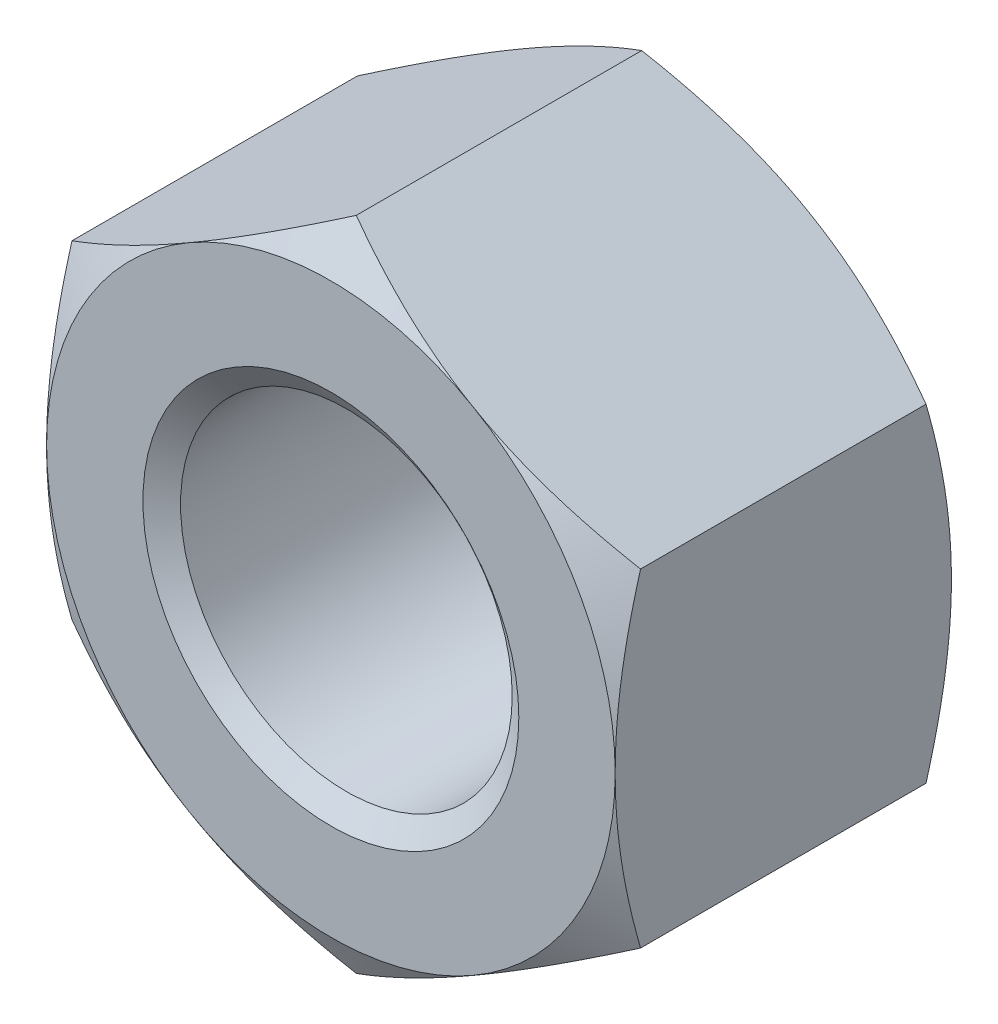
ISO-10303-21;
HEADER;
FILE_DESCRIPTION(('STEP AP214'),'2;1');
FILE_NAME('part.step','',(''),(''),'','','');
FILE_SCHEMA(('AUTOMOTIVE_DESIGN { 1 0 10303 214 1 1 1 1 }'));
ENDSEC;
DATA;
#1=APPLICATION_CONTEXT('core data for automotive mechanical design processes');
#2=APPLICATION_PROTOCOL_DEFINITION('international standard','automotive_design',2000,#1);
#3=PRODUCT_CONTEXT('',#1,'mechanical');
#4=PRODUCT('Part','Part','',(#3));
#5=PRODUCT_RELATED_PRODUCT_CATEGORY('part','',(#4));
#6=PRODUCT_DEFINITION_FORMATION('','',#4);
#7=PRODUCT_DEFINITION_CONTEXT('part definition',#1,'design');
#8=PRODUCT_DEFINITION('design','',#6,#7);
#9=PRODUCT_DEFINITION_SHAPE('','',#8);
#10=(LENGTH_UNIT() NAMED_UNIT(*) SI_UNIT(.MILLI.,.METRE.));
#11=(NAMED_UNIT(*) PLANE_ANGLE_UNIT() SI_UNIT($,.RADIAN.));
#12=(NAMED_UNIT(*) SI_UNIT($,.STERADIAN.) SOLID_ANGLE_UNIT());
#13=UNCERTAINTY_MEASURE_WITH_UNIT(LENGTH_MEASURE(1.E-05),#10,'distance_accuracy_value','');
#14=(GEOMETRIC_REPRESENTATION_CONTEXT(3) GLOBAL_UNCERTAINTY_ASSIGNED_CONTEXT((#13)) GLOBAL_UNIT_ASSIGNED_CONTEXT((#10,
#11,#12)) REPRESENTATION_CONTEXT('',''));
#15=CARTESIAN_POINT('',(0.,0.,0.));
#16=DIRECTION('',(0.,0.,1.));
#17=DIRECTION('',(1.,0.,0.));
#18=AXIS2_PLACEMENT_3D('',#15,#16,#17);
#19=CARTESIAN_POINT('',(0.,21.9970452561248,-22.5298));
#20=DIRECTION('',(-0.500000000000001,0.866025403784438,0.));
#21=DIRECTION('',(-0.866025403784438,-0.500000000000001,0.));
#22=AXIS2_PLACEMENT_3D('',#19,#20,#21);
#23=PLANE('',#22);
#24=DIRECTION('',(0.,0.,1.));
#25=VECTOR('',#24,1.);
#26=CARTESIAN_POINT('',(-19.05,10.9985226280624,-22.5298));
#27=LINE('',#26,#25);
#28=CARTESIAN_POINT('',(-19.05,10.9985226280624,-20.8283226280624));
#29=VERTEX_POINT('',#28);
#30=CARTESIAN_POINT('',(-19.05,10.9985226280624,-1.70147737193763));
#31=VERTEX_POINT('',#30);
#32=EDGE_CURVE('E162',#29,#31,#27,.T.);
#33=ORIENTED_EDGE('',*,*,#32,.T.);
#34=CARTESIAN_POINT('',(-19.0502,10.9984071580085,-1.70154403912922));
#35=CARTESIAN_POINT('',(-18.6314889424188,11.2401500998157,-1.56198341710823));
#36=CARTESIAN_POINT('',(-18.2111446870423,11.4828359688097,-1.42875584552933));
#37=CARTESIAN_POINT('',(-17.3670855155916,11.9701537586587,-1.17672716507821));
#38=CARTESIAN_POINT('',(-16.9433695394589,12.2147862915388,-1.05793080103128));
#39=CARTESIAN_POINT('',(-16.0917480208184,12.7064702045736,-0.836361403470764));
#40=CARTESIAN_POINT('',(-15.6638350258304,12.9535258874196,-0.733626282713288));
#41=CARTESIAN_POINT('',(-14.8050356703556,13.4493539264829,-0.546385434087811));
#42=CARTESIAN_POINT('',(-14.374149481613,13.6981261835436,-0.461878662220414));
#43=CARTESIAN_POINT('',(-13.5204444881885,14.1910129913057,-0.314688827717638));
#44=CARTESIAN_POINT('',(-13.0976890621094,14.4350909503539,-0.251518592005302));
#45=CARTESIAN_POINT('',(-12.250241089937,14.9243652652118,-0.145596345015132));
#46=CARTESIAN_POINT('',(-11.8255485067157,15.1695616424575,-0.10284472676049));
#47=CARTESIAN_POINT('',(-10.9754499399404,15.6603662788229,-0.0388391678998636));
#48=CARTESIAN_POINT('',(-10.5500454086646,15.9059736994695,-0.0175596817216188));
#49=CARTESIAN_POINT('',(-9.69884369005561,16.397415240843,0.00304398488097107));
#50=CARTESIAN_POINT('',(-9.27304651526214,16.6432493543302,0.0023688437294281));
#51=CARTESIAN_POINT('',(-8.47700964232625,17.1028414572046,-0.0194033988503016));
#52=CARTESIAN_POINT('',(-8.10671322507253,17.316632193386,-0.0378455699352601));
#53=CARTESIAN_POINT('',(-7.36700369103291,17.7437036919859,-0.0909844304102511));
#54=CARTESIAN_POINT('',(-6.99759056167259,17.9569844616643,-0.125680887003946));
#55=CARTESIAN_POINT('',(-6.25978756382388,18.3829552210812,-0.210726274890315));
#56=CARTESIAN_POINT('',(-5.89139892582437,18.5956445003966,-0.261089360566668));
#57=CARTESIAN_POINT('',(-5.15637533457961,19.0200105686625,-0.376579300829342));
#58=CARTESIAN_POINT('',(-4.78974037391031,19.2316873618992,-0.441706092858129));
#59=CARTESIAN_POINT('',(-3.67677271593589,19.8742595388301,-0.660888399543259));
#60=CARTESIAN_POINT('',(-2.93366305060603,20.3032941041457,-0.836799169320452));
#61=CARTESIAN_POINT('',(-1.45852420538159,21.1549659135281,-1.23604434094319));
#62=CARTESIAN_POINT('',(-0.726476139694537,21.5776140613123,-1.45928498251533));
#63=CARTESIAN_POINT('',(0.000200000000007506,21.9971607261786,-1.70154403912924));
#64=B_SPLINE_CURVE_WITH_KNOTS('',3,(#34,#35,#36,#37,#38,#39,#40,#41,#42,#43,#44,#45,#46,#47,#48,
#49,#50,#51,#52,#53,#54,#55,#56,#57,#58,#59,#60,#61,#62,#63),.UNSPECIFIED.,.F.,.F.,(4,2,2,2,2,2,
2,2,2,2,2,2,2,2,4),(0.,1.50971559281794,3.01992622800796,4.53364959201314,6.04728623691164,
7.52356313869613,8.99986845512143,10.4744153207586,11.9489166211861,13.2325441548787,
14.5161533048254,15.8009255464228,17.085692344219,19.7118183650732,22.3327898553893),.UNSPECIFIED.);
#65=CARTESIAN_POINT('',(-9.52500000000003,16.4977839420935,0.));
#66=VERTEX_POINT('',#65);
#67=EDGE_CURVE('E58',#31,#66,#64,.T.);
#68=ORIENTED_EDGE('',*,*,#67,.T.);
#69=CARTESIAN_POINT('',(0.,21.9970452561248,-1.70147737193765));
#70=VERTEX_POINT('',#69);
#71=EDGE_CURVE('E206',#66,#70,#64,.T.);
#72=ORIENTED_EDGE('',*,*,#71,.T.);
#73=DIRECTION('',(0.,0.,1.));
#74=VECTOR('',#73,1.);
#75=CARTESIAN_POINT('',(0.,21.9970452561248,-22.5298));
#76=LINE('',#75,#74);
#77=CARTESIAN_POINT('',(0.,21.9970452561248,-20.8283226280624));
#78=VERTEX_POINT('',#77);
#79=EDGE_CURVE('E147',#78,#70,#76,.T.);
#80=ORIENTED_EDGE('',*,*,#79,.F.);
#81=CARTESIAN_POINT('',(-19.0502,10.9984071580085,-20.8282559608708));
#82=CARTESIAN_POINT('',(-18.6314889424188,11.2401500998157,-20.9678165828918));
#83=CARTESIAN_POINT('',(-18.2111446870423,11.4828359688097,-21.1010441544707));
#84=CARTESIAN_POINT('',(-17.3670855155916,11.9701537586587,-21.3530728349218));
#85=CARTESIAN_POINT('',(-16.9433695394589,12.2147862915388,-21.4718691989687));
#86=CARTESIAN_POINT('',(-16.0917480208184,12.7064702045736,-21.6934385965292));
#87=CARTESIAN_POINT('',(-15.6638350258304,12.9535258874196,-21.7961737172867));
#88=CARTESIAN_POINT('',(-14.8050356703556,13.4493539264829,-21.9834145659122));
#89=CARTESIAN_POINT('',(-14.374149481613,13.6981261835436,-22.0679213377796));
#90=CARTESIAN_POINT('',(-13.5204444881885,14.1910129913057,-22.2151111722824));
#91=CARTESIAN_POINT('',(-13.0976890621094,14.4350909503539,-22.2782814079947));
#92=CARTESIAN_POINT('',(-12.250241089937,14.9243652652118,-22.3842036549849));
#93=CARTESIAN_POINT('',(-11.8255485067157,15.1695616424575,-22.4269552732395));
#94=CARTESIAN_POINT('',(-10.9754499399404,15.6603662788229,-22.4909608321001));
#95=CARTESIAN_POINT('',(-10.5500454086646,15.9059736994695,-22.5122403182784));
#96=CARTESIAN_POINT('',(-9.69884369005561,16.397415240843,-22.532843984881));
#97=CARTESIAN_POINT('',(-9.27304651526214,16.6432493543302,-22.5321688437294));
#98=CARTESIAN_POINT('',(-8.47700964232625,17.1028414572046,-22.5103966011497));
#99=CARTESIAN_POINT('',(-8.10671322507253,17.316632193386,-22.4919544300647));
#100=CARTESIAN_POINT('',(-7.36700369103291,17.7437036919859,-22.4388155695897));
#101=CARTESIAN_POINT('',(-6.99759056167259,17.9569844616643,-22.4041191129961));
#102=CARTESIAN_POINT('',(-6.25978756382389,18.3829552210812,-22.3190737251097));
#103=CARTESIAN_POINT('',(-5.89139892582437,18.5956445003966,-22.2687106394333));
#104=CARTESIAN_POINT('',(-5.15637533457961,19.0200105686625,-22.1532206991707));
#105=CARTESIAN_POINT('',(-4.78974037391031,19.2316873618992,-22.0880939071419));
#106=CARTESIAN_POINT('',(-3.67677271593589,19.8742595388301,-21.8689116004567));
#107=CARTESIAN_POINT('',(-2.93366305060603,20.3032941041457,-21.6930008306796));
#108=CARTESIAN_POINT('',(-1.45852420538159,21.1549659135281,-21.2937556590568));
#109=CARTESIAN_POINT('',(-0.726476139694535,21.5776140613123,-21.0705150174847));
#110=CARTESIAN_POINT('',(0.00020000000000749,21.9971607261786,-20.8282559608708));
#111=B_SPLINE_CURVE_WITH_KNOTS('',3,(#81,#82,#83,#84,#85,#86,#87,#88,#89,#90,#91,#92,#93,#94,
#95,#96,#97,#98,#99,#100,#101,#102,#103,#104,#105,#106,#107,#108,#109,#110),.UNSPECIFIED.,.F.,
.F.,(4,2,2,2,2,2,2,2,2,2,2,2,2,2,4),(0.,1.50971559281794,3.01992622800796,4.53364959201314,
6.04728623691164,7.52356313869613,8.99986845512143,10.4744153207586,11.9489166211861,
13.2325441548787,14.5161533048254,15.8009255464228,17.085692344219,19.7118183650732,
22.3327898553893),.UNSPECIFIED.);
#112=CARTESIAN_POINT('',(-9.52500000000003,16.4977839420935,-22.5298));
#113=VERTEX_POINT('',#112);
#114=EDGE_CURVE('E165',#113,#78,#111,.T.);
#115=ORIENTED_EDGE('',*,*,#114,.F.);
#116=EDGE_CURVE('E212',#29,#113,#111,.T.);
#117=ORIENTED_EDGE('',*,*,#116,.F.);
#118=EDGE_LOOP('',(#33,#68,#72,#80,#115,#117));
#119=FACE_BOUND('',#118,.T.);
#120=ADVANCED_FACE('F35',(#119),#23,.T.);
#121=CARTESIAN_POINT('',(19.05,10.9985226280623,-22.5298));
#122=DIRECTION('',(0.500000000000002,0.866025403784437,0.));
#123=DIRECTION('',(-0.866025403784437,0.500000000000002,0.));
#124=AXIS2_PLACEMENT_3D('',#121,#122,#123);
#125=PLANE('',#124);
#126=ORIENTED_EDGE('',*,*,#79,.T.);
#127=CARTESIAN_POINT('',(-0.000199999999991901,21.9971607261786,-1.70154403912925));
#128=CARTESIAN_POINT('',(0.418511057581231,21.7554177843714,-1.56198341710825));
#129=CARTESIAN_POINT('',(0.838855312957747,21.5127319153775,-1.42875584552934));
#130=CARTESIAN_POINT('',(1.68291448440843,21.0254141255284,-1.17672716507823));
#131=CARTESIAN_POINT('',(2.10663046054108,20.7807815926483,-1.05793080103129));
#132=CARTESIAN_POINT('',(2.95825197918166,20.2890976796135,-0.836361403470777));
#133=CARTESIAN_POINT('',(3.38616497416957,20.0420419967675,-0.733626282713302));
#134=CARTESIAN_POINT('',(4.24496432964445,19.5462139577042,-0.546385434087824));
#135=CARTESIAN_POINT('',(4.67585051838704,19.2974417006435,-0.461878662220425));
#136=CARTESIAN_POINT('',(5.52955551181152,18.8045548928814,-0.314688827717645));
#137=CARTESIAN_POINT('',(5.95231093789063,18.5604769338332,-0.251518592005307));
#138=CARTESIAN_POINT('',(6.799758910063,18.0712026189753,-0.145596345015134));
#139=CARTESIAN_POINT('',(7.22445149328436,17.8260062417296,-0.102844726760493));
#140=CARTESIAN_POINT('',(8.07455006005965,17.3352016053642,-0.0388391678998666));
#141=CARTESIAN_POINT('',(8.49995459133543,17.0895941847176,-0.0175596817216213));
#142=CARTESIAN_POINT('',(9.35115630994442,16.5981526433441,0.00304398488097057));
#143=CARTESIAN_POINT('',(9.77695348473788,16.3523185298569,0.00236884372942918));
#144=CARTESIAN_POINT('',(10.5729903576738,15.8927264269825,-0.0194033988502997));
#145=CARTESIAN_POINT('',(10.9432867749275,15.6789356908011,-0.0378455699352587));
#146=CARTESIAN_POINT('',(11.6829963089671,15.2518641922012,-0.0909844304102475));
#147=CARTESIAN_POINT('',(12.0524094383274,15.0385834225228,-0.12568088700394));
#148=CARTESIAN_POINT('',(12.7902124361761,14.6126126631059,-0.210726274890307));
#149=CARTESIAN_POINT('',(13.1586010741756,14.3999233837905,-0.261089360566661));
#150=CARTESIAN_POINT('',(13.8936246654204,13.9755573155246,-0.376579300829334));
#151=CARTESIAN_POINT('',(14.2602596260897,13.7638805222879,-0.441706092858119));
#152=CARTESIAN_POINT('',(15.3732272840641,13.121308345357,-0.660888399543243));
#153=CARTESIAN_POINT('',(16.116336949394,12.6922737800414,-0.836799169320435));
#154=CARTESIAN_POINT('',(17.5914757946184,11.840601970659,-1.23604434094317));
#155=CARTESIAN_POINT('',(18.3235238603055,11.4179538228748,-1.45928498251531));
#156=CARTESIAN_POINT('',(19.0502,10.9984071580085,-1.70154403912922));
#157=B_SPLINE_CURVE_WITH_KNOTS('',3,(#127,#128,#129,#130,#131,#132,#133,#134,#135,#136,#137,
#138,#139,#140,#141,#142,#143,#144,#145,#146,#147,#148,#149,#150,#151,#152,#153,#154,#155,#156),
.UNSPECIFIED.,.F.,.F.,(4,2,2,2,2,2,2,2,2,2,2,2,2,2,4),(0.,1.50971559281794,3.01992622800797,
4.53364959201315,6.04728623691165,7.52356313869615,8.99986845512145,10.4744153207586,
11.9489166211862,13.2325441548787,14.5161533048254,15.8009255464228,17.085692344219,
19.7118183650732,22.3327898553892),.UNSPECIFIED.);
#158=CARTESIAN_POINT('',(9.52500000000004,16.4977839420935,0.));
#159=VERTEX_POINT('',#158);
#160=EDGE_CURVE('E140',#70,#159,#157,.T.);
#161=ORIENTED_EDGE('',*,*,#160,.T.);
#162=CARTESIAN_POINT('',(19.05,10.9985226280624,-1.70147737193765));
#163=VERTEX_POINT('',#162);
#164=EDGE_CURVE('E126',#159,#163,#157,.T.);
#165=ORIENTED_EDGE('',*,*,#164,.T.);
#166=DIRECTION('',(0.,0.,1.));
#167=VECTOR('',#166,1.);
#168=CARTESIAN_POINT('',(19.05,10.9985226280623,-22.5298));
#169=LINE('',#168,#167);
#170=CARTESIAN_POINT('',(19.05,10.9985226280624,-20.8283226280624));
#171=VERTEX_POINT('',#170);
#172=EDGE_CURVE('E139',#171,#163,#169,.T.);
#173=ORIENTED_EDGE('',*,*,#172,.F.);
#174=CARTESIAN_POINT('',(-0.000199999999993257,21.9971607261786,-20.8282559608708));
#175=CARTESIAN_POINT('',(0.418511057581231,21.7554177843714,-20.9678165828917));
#176=CARTESIAN_POINT('',(0.838855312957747,21.5127319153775,-21.1010441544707));
#177=CARTESIAN_POINT('',(1.68291448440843,21.0254141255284,-21.3530728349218));
#178=CARTESIAN_POINT('',(2.10663046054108,20.7807815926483,-21.4718691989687));
#179=CARTESIAN_POINT('',(2.95825197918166,20.2890976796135,-21.6934385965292));
#180=CARTESIAN_POINT('',(3.38616497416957,20.0420419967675,-21.7961737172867));
#181=CARTESIAN_POINT('',(4.24496432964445,19.5462139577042,-21.9834145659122));
#182=CARTESIAN_POINT('',(4.67585051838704,19.2974417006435,-22.0679213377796));
#183=CARTESIAN_POINT('',(5.52955551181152,18.8045548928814,-22.2151111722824));
#184=CARTESIAN_POINT('',(5.95231093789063,18.5604769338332,-22.2782814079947));
#185=CARTESIAN_POINT('',(6.799758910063,18.0712026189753,-22.3842036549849));
#186=CARTESIAN_POINT('',(7.22445149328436,17.8260062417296,-22.4269552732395));
#187=CARTESIAN_POINT('',(8.07455006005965,17.3352016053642,-22.4909608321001));
#188=CARTESIAN_POINT('',(8.49995459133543,17.0895941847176,-22.5122403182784));
#189=CARTESIAN_POINT('',(9.35115630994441,16.5981526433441,-22.532843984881));
#190=CARTESIAN_POINT('',(9.77695348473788,16.3523185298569,-22.5321688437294));
#191=CARTESIAN_POINT('',(10.5729903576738,15.8927264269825,-22.5103966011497));
#192=CARTESIAN_POINT('',(10.9432867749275,15.6789356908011,-22.4919544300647));
#193=CARTESIAN_POINT('',(11.6829963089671,15.2518641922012,-22.4388155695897));
#194=CARTESIAN_POINT('',(12.0524094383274,15.0385834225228,-22.4041191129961));
#195=CARTESIAN_POINT('',(12.7902124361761,14.6126126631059,-22.3190737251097));
#196=CARTESIAN_POINT('',(13.1586010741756,14.3999233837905,-22.2687106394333));
#197=CARTESIAN_POINT('',(13.8936246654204,13.9755573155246,-22.1532206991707));
#198=CARTESIAN_POINT('',(14.2602596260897,13.7638805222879,-22.0880939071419));
#199=CARTESIAN_POINT('',(15.3732272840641,13.121308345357,-21.8689116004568));
#200=CARTESIAN_POINT('',(16.116336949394,12.6922737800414,-21.6930008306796));
#201=CARTESIAN_POINT('',(17.5914757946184,11.840601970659,-21.2937556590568));
#202=CARTESIAN_POINT('',(18.3235238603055,11.4179538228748,-21.0705150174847));
#203=CARTESIAN_POINT('',(19.0502,10.9984071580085,-20.8282559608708));
#204=B_SPLINE_CURVE_WITH_KNOTS('',3,(#174,#175,#176,#177,#178,#179,#180,#181,#182,#183,#184,
#185,#186,#187,#188,#189,#190,#191,#192,#193,#194,#195,#196,#197,#198,#199,#200,#201,#202,#203),
.UNSPECIFIED.,.F.,.F.,(4,2,2,2,2,2,2,2,2,2,2,2,2,2,4),(0.,1.50971559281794,3.01992622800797,
4.53364959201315,6.04728623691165,7.52356313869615,8.99986845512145,10.4744153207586,
11.9489166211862,13.2325441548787,14.5161533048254,15.8009255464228,17.085692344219,
19.7118183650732,22.3327898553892),.UNSPECIFIED.);
#205=CARTESIAN_POINT('',(9.52500000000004,16.4977839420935,-22.5298));
#206=VERTEX_POINT('',#205);
#207=EDGE_CURVE('E223',#206,#171,#204,.T.);
#208=ORIENTED_EDGE('',*,*,#207,.F.);
#209=EDGE_CURVE('E224',#78,#206,#204,.T.);
#210=ORIENTED_EDGE('',*,*,#209,.F.);
#211=EDGE_LOOP('',(#126,#161,#165,#173,#208,#210));
#212=FACE_BOUND('',#211,.T.);
#213=ADVANCED_FACE('F137',(#212),#125,.T.);
#214=CARTESIAN_POINT('',(19.05,10.9985226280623,-22.5298));
#215=DIRECTION('',(-1.,0.,0.));
#216=DIRECTION('',(0.,0.,1.));
#217=AXIS2_PLACEMENT_3D('',#214,#215,#216);
#218=PLANE('',#217);
#219=CARTESIAN_POINT('',(19.05,-29.1697028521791,-9.11593373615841));
#220=CARTESIAN_POINT('',(19.05,-28.7515170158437,-8.91378890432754));
#221=CARTESIAN_POINT('',(19.05,-28.3328257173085,-8.71269026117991));
#222=CARTESIAN_POINT('',(19.05,-27.494325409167,-8.31282549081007));
#223=CARTESIAN_POINT('',(19.05,-27.0745163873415,-8.11405938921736));
#224=CARTESIAN_POINT('',(19.05,-25.813129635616,-7.52156252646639));
#225=CARTESIAN_POINT('',(19.05,-24.9697281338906,-7.13169909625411));
#226=CARTESIAN_POINT('',(19.05,-23.2722707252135,-6.36257122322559));
#227=CARTESIAN_POINT('',(19.05,-22.4181814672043,-5.98338020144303));
#228=CARTESIAN_POINT('',(19.05,-20.7029839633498,-5.24127883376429));
#229=CARTESIAN_POINT('',(19.05,-19.8418760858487,-4.87836763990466));
#230=CARTESIAN_POINT('',(19.05,-18.1005821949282,-4.16885698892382));
#231=CARTESIAN_POINT('',(19.05,-17.2202917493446,-3.8225124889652));
#232=CARTESIAN_POINT('',(19.05,-15.4493217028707,-3.15694792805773));
#233=CARTESIAN_POINT('',(19.05,-14.5586409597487,-2.83773088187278));
#234=CARTESIAN_POINT('',(19.05,-12.7673320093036,-2.23500280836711));
#235=CARTESIAN_POINT('',(19.05,-11.8667295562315,-1.95141586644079));
#236=CARTESIAN_POINT('',(19.05,-10.0526343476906,-1.42914392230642));
#237=CARTESIAN_POINT('',(19.05,-9.13914576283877,-1.19044473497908));
#238=CARTESIAN_POINT('',(19.05,-7.75907469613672,-0.87479986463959));
#239=CARTESIAN_POINT('',(19.05,-7.29731333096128,-0.77663607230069));
#240=CARTESIAN_POINT('',(19.05,-6.37071732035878,-0.595993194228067));
#241=CARTESIAN_POINT('',(19.05,-5.90588274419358,-0.513513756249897));
#242=CARTESIAN_POINT('',(19.05,-4.97345228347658,-0.365701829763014));
#243=CARTESIAN_POINT('',(19.05,-4.50585623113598,-0.300370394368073));
#244=CARTESIAN_POINT('',(19.05,-3.56843861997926,-0.188166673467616));
#245=CARTESIAN_POINT('',(19.05,-3.09861705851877,-0.141294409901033));
#246=CARTESIAN_POINT('',(19.05,-2.16041609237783,-0.0672708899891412));
#247=CARTESIAN_POINT('',(19.05,-1.69204648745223,-0.0399962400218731));
#248=CARTESIAN_POINT('',(19.05,-0.754574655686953,-0.00531133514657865));
#249=CARTESIAN_POINT('',(19.05,-0.285472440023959,0.00209921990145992));
#250=CARTESIAN_POINT('',(19.05,0.652492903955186,-0.00311981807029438));
#251=CARTESIAN_POINT('',(19.05,1.12135606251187,-0.01574386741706));
#252=CARTESIAN_POINT('',(19.05,2.05813737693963,-0.0607182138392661));
#253=CARTESIAN_POINT('',(19.05,2.52605549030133,-0.0930693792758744));
#254=CARTESIAN_POINT('',(19.05,3.65980250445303,-0.194680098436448));
#255=CARTESIAN_POINT('',(19.05,4.32476458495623,-0.273803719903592));
#256=CARTESIAN_POINT('',(19.05,5.64947952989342,-0.467485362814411));
#257=CARTESIAN_POINT('',(19.05,6.30923160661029,-0.582048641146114));
#258=CARTESIAN_POINT('',(19.05,8.28182382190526,-0.97315181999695));
#259=CARTESIAN_POINT('',(19.05,9.58542312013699,-1.29684470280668));
#260=CARTESIAN_POINT('',(19.05,11.5353898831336,-1.85499845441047));
#261=CARTESIAN_POINT('',(19.05,12.191945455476,-2.05588340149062));
#262=CARTESIAN_POINT('',(19.05,13.498713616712,-2.47768236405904));
#263=CARTESIAN_POINT('',(19.05,14.1489256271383,-2.69859818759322));
#264=CARTESIAN_POINT('',(19.05,15.4397656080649,-3.15575174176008));
#265=CARTESIAN_POINT('',(19.05,16.080426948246,-3.39189604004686));
#266=CARTESIAN_POINT('',(19.05,17.0373840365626,-3.75633654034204));
#267=CARTESIAN_POINT('',(19.05,17.3556458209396,-3.87949985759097));
#268=CARTESIAN_POINT('',(19.05,17.9909330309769,-4.12895791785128));
#269=CARTESIAN_POINT('',(19.05,18.3079584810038,-4.25525259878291));
#270=CARTESIAN_POINT('',(19.05,18.6244086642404,-4.38297164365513));
#271=B_SPLINE_CURVE_WITH_KNOTS('',3,(#219,#220,#221,#222,#223,#224,#225,#226,#227,#228,#229,
#230,#231,#232,#233,#234,#235,#236,#237,#238,#239,#240,#241,#242,#243,#244,#245,#246,#247,#248,
#249,#250,#251,#252,#253,#254,#255,#256,#257,#258,#259,#260,#261,#262,#263,#264,#265,#266,#267,
#268,#269,#270),.UNSPECIFIED.,.F.,.F.,(4,2,2,2,2,2,2,2,2,2,2,2,2,2,2,2,2,2,2,2,2,2,2,2,2,4),(0.,
1.39343811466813,2.78689152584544,5.57425145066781,8.37756231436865,11.1807269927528,
14.0183059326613,16.856199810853,19.6879407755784,22.5187853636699,23.934802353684,
25.3507875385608,26.766859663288,28.1829334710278,29.5900111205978,30.9970675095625,
32.4037346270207,33.8104636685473,35.8182820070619,37.8263983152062,41.8503661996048,
43.910005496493,45.9698308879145,48.0180400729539,49.0418117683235,50.0655631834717),.UNSPECIFIED.);
#272=CARTESIAN_POINT('',(19.05,-10.9985226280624,-1.70147737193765));
#273=VERTEX_POINT('',#272);
#274=CARTESIAN_POINT('',(19.05,0.,0.));
#275=VERTEX_POINT('',#274);
#276=EDGE_CURVE('E132',#273,#275,#271,.T.);
#277=ORIENTED_EDGE('',*,*,#276,.F.);
#278=DIRECTION('',(0.,0.,1.));
#279=VECTOR('',#278,1.);
#280=CARTESIAN_POINT('',(19.05,-10.9985226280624,-22.5298));
#281=LINE('',#280,#279);
#282=CARTESIAN_POINT('',(19.05,-10.9985226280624,-20.8283226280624));
#283=VERTEX_POINT('',#282);
#284=EDGE_CURVE('E148',#283,#273,#281,.T.);
#285=ORIENTED_EDGE('',*,*,#284,.F.);
#286=CARTESIAN_POINT('',(19.05,-29.1697028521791,-13.4138662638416));
#287=CARTESIAN_POINT('',(19.05,-28.7515170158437,-13.6160110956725));
#288=CARTESIAN_POINT('',(19.05,-28.3328257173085,-13.8171097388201));
#289=CARTESIAN_POINT('',(19.05,-27.494325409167,-14.2169745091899));
#290=CARTESIAN_POINT('',(19.05,-27.0745163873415,-14.4157406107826));
#291=CARTESIAN_POINT('',(19.05,-25.813129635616,-15.0082374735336));
#292=CARTESIAN_POINT('',(19.05,-24.9697281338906,-15.3981009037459));
#293=CARTESIAN_POINT('',(19.05,-23.2722707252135,-16.1672287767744));
#294=CARTESIAN_POINT('',(19.05,-22.4181814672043,-16.546419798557));
#295=CARTESIAN_POINT('',(19.05,-20.7029839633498,-17.2885211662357));
#296=CARTESIAN_POINT('',(19.05,-19.8418760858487,-17.6514323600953));
#297=CARTESIAN_POINT('',(19.05,-18.1005821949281,-18.3609430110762));
#298=CARTESIAN_POINT('',(19.05,-17.2202917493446,-18.7072875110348));
#299=CARTESIAN_POINT('',(19.05,-15.4493217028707,-19.3728520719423));
#300=CARTESIAN_POINT('',(19.05,-14.5586409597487,-19.6920691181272));
#301=CARTESIAN_POINT('',(19.05,-12.7673320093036,-20.2947971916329));
#302=CARTESIAN_POINT('',(19.05,-11.8667295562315,-20.5783841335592));
#303=CARTESIAN_POINT('',(19.05,-10.0526343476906,-21.1006560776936));
#304=CARTESIAN_POINT('',(19.05,-9.13914576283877,-21.3393552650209));
#305=CARTESIAN_POINT('',(19.05,-7.75907469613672,-21.6550001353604));
#306=CARTESIAN_POINT('',(19.05,-7.29731333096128,-21.7531639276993));
#307=CARTESIAN_POINT('',(19.05,-6.37071732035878,-21.9338068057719));
#308=CARTESIAN_POINT('',(19.05,-5.90588274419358,-22.0162862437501));
#309=CARTESIAN_POINT('',(19.05,-4.97345228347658,-22.164098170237));
#310=CARTESIAN_POINT('',(19.05,-4.50585623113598,-22.2294296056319));
#311=CARTESIAN_POINT('',(19.05,-3.56843861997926,-22.3416333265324));
#312=CARTESIAN_POINT('',(19.05,-3.09861705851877,-22.388505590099));
#313=CARTESIAN_POINT('',(19.05,-2.16041609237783,-22.4625291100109));
#314=CARTESIAN_POINT('',(19.05,-1.69204648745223,-22.4898037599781));
#315=CARTESIAN_POINT('',(19.05,-0.754574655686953,-22.5244886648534));
#316=CARTESIAN_POINT('',(19.05,-0.285472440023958,-22.5318992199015));
#317=CARTESIAN_POINT('',(19.05,0.652492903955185,-22.5266801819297));
#318=CARTESIAN_POINT('',(19.05,1.12135606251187,-22.5140561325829));
#319=CARTESIAN_POINT('',(19.05,2.05813737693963,-22.4690817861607));
#320=CARTESIAN_POINT('',(19.05,2.52605549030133,-22.4367306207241));
#321=CARTESIAN_POINT('',(19.05,3.65980250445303,-22.3351199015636));
#322=CARTESIAN_POINT('',(19.05,4.32476458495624,-22.2559962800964));
#323=CARTESIAN_POINT('',(19.05,5.64947952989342,-22.0623146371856));
#324=CARTESIAN_POINT('',(19.05,6.30923160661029,-21.9477513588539));
#325=CARTESIAN_POINT('',(19.05,8.28182382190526,-21.556648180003));
#326=CARTESIAN_POINT('',(19.05,9.58542312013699,-21.2329552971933));
#327=CARTESIAN_POINT('',(19.05,11.5353898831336,-20.6748015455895));
#328=CARTESIAN_POINT('',(19.05,12.191945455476,-20.4739165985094));
#329=CARTESIAN_POINT('',(19.05,13.498713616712,-20.052117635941));
#330=CARTESIAN_POINT('',(19.05,14.1489256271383,-19.8312018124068));
#331=CARTESIAN_POINT('',(19.05,15.4397656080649,-19.3740482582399));
#332=CARTESIAN_POINT('',(19.05,16.080426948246,-19.1379039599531));
#333=CARTESIAN_POINT('',(19.05,17.0373840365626,-18.773463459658));
#334=CARTESIAN_POINT('',(19.05,17.3556458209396,-18.650300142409));
#335=CARTESIAN_POINT('',(19.05,17.9909330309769,-18.4008420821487));
#336=CARTESIAN_POINT('',(19.05,18.3079584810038,-18.2745474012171));
#337=CARTESIAN_POINT('',(19.05,18.6244086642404,-18.1468283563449));
#338=B_SPLINE_CURVE_WITH_KNOTS('',3,(#286,#287,#288,#289,#290,#291,#292,#293,#294,#295,#296,
#297,#298,#299,#300,#301,#302,#303,#304,#305,#306,#307,#308,#309,#310,#311,#312,#313,#314,#315,
#316,#317,#318,#319,#320,#321,#322,#323,#324,#325,#326,#327,#328,#329,#330,#331,#332,#333,#334,
#335,#336,#337),.UNSPECIFIED.,.F.,.F.,(4,2,2,2,2,2,2,2,2,2,2,2,2,2,2,2,2,2,2,2,2,2,2,2,2,4),(0.,
1.39343811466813,2.78689152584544,5.57425145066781,8.37756231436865,11.1807269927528,
14.0183059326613,16.856199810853,19.6879407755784,22.5187853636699,23.934802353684,
25.3507875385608,26.766859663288,28.1829334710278,29.5900111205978,30.9970675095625,
32.4037346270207,33.8104636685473,35.8182820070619,37.8263983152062,41.8503661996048,
43.910005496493,45.9698308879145,48.0180400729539,49.0418117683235,50.0655631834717),.UNSPECIFIED.);
#339=CARTESIAN_POINT('',(19.05,0.,-22.5298));
#340=VERTEX_POINT('',#339);
#341=EDGE_CURVE('E209',#283,#340,#338,.T.);
#342=ORIENTED_EDGE('',*,*,#341,.T.);
#343=EDGE_CURVE('E146',#340,#171,#338,.T.);
#344=ORIENTED_EDGE('',*,*,#343,.T.);
#345=ORIENTED_EDGE('',*,*,#172,.T.);
#346=EDGE_CURVE('E123',#275,#163,#271,.T.);
#347=ORIENTED_EDGE('',*,*,#346,.F.);
#348=EDGE_LOOP('',(#277,#285,#342,#344,#345,#347));
#349=FACE_BOUND('',#348,.T.);
#350=ADVANCED_FACE('F143',(#349),#218,.F.);
#351=CARTESIAN_POINT('',(0.,-21.9970452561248,-22.5298));
#352=DIRECTION('',(0.500000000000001,-0.866025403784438,0.));
#353=DIRECTION('',(0.866025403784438,0.500000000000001,0.));
#354=AXIS2_PLACEMENT_3D('',#351,#352,#353);
#355=PLANE('',#354);
#356=ORIENTED_EDGE('',*,*,#284,.T.);
#357=CARTESIAN_POINT('',(19.0502,-10.9984071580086,-1.70154403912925));
#358=CARTESIAN_POINT('',(18.6314889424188,-11.2401500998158,-1.56198341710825));
#359=CARTESIAN_POINT('',(18.2111446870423,-11.4828359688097,-1.42875584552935));
#360=CARTESIAN_POINT('',(17.3670855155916,-11.9701537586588,-1.17672716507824));
#361=CARTESIAN_POINT('',(16.9433695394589,-12.2147862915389,-1.0579308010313));
#362=CARTESIAN_POINT('',(16.0917480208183,-12.7064702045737,-0.836361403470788));
#363=CARTESIAN_POINT('',(15.6638350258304,-12.9535258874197,-0.733626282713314));
#364=CARTESIAN_POINT('',(14.8050356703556,-13.449353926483,-0.546385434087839));
#365=CARTESIAN_POINT('',(14.374149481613,-13.6981261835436,-0.461878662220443));
#366=CARTESIAN_POINT('',(13.5204444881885,-14.1910129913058,-0.314688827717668));
#367=CARTESIAN_POINT('',(13.0976890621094,-14.435090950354,-0.251518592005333));
#368=CARTESIAN_POINT('',(12.250241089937,-14.9243652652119,-0.145596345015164));
#369=CARTESIAN_POINT('',(11.8255485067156,-15.1695616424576,-0.102844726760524));
#370=CARTESIAN_POINT('',(10.9754499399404,-15.660366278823,-0.0388391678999));
#371=CARTESIAN_POINT('',(10.5500454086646,-15.9059736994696,-0.0175596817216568));
#372=CARTESIAN_POINT('',(9.69884369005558,-16.3974152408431,0.00304398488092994));
#373=CARTESIAN_POINT('',(9.27304651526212,-16.6432493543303,0.00236884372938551));
#374=CARTESIAN_POINT('',(8.47700964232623,-17.1028414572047,-0.0194033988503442));
#375=CARTESIAN_POINT('',(8.1067132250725,-17.3166321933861,-0.0378455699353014));
#376=CARTESIAN_POINT('',(7.36700369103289,-17.743703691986,-0.090984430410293));
#377=CARTESIAN_POINT('',(6.99759056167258,-17.9569844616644,-0.12568088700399));
#378=CARTESIAN_POINT('',(6.25978756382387,-18.3829552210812,-0.210726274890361));
#379=CARTESIAN_POINT('',(5.89139892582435,-18.5956445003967,-0.261089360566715));
#380=CARTESIAN_POINT('',(5.15637533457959,-19.0200105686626,-0.376579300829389));
#381=CARTESIAN_POINT('',(4.78974037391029,-19.2316873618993,-0.441706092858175));
#382=CARTESIAN_POINT('',(3.67677271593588,-19.8742595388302,-0.660888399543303));
#383=CARTESIAN_POINT('',(2.93366305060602,-20.3032941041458,-0.836799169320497));
#384=CARTESIAN_POINT('',(1.45852420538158,-21.1549659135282,-1.23604434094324));
#385=CARTESIAN_POINT('',(0.726476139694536,-21.5776140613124,-1.45928498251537));
#386=CARTESIAN_POINT('',(-0.000200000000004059,-21.9971607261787,-1.70154403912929));
#387=B_SPLINE_CURVE_WITH_KNOTS('',3,(#357,#358,#359,#360,#361,#362,#363,#364,#365,#366,#367,
#368,#369,#370,#371,#372,#373,#374,#375,#376,#377,#378,#379,#380,#381,#382,#383,#384,#385,#386),
.UNSPECIFIED.,.F.,.F.,(4,2,2,2,2,2,2,2,2,2,2,2,2,2,4),(0.,1.50971559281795,3.01992622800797,
4.53364959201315,6.04728623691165,7.52356313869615,8.99986845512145,10.4744153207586,
11.9489166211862,13.2325441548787,14.5161533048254,15.8009255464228,17.085692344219,
19.7118183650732,22.3327898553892),.UNSPECIFIED.);
#388=CARTESIAN_POINT('',(9.52500000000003,-16.4977839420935,0.));
#389=VERTEX_POINT('',#388);
#390=EDGE_CURVE('E282',#273,#389,#387,.T.);
#391=ORIENTED_EDGE('',*,*,#390,.T.);
#392=CARTESIAN_POINT('',(-1.42247325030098E-13,-21.9970452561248,-1.70147737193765));
#393=VERTEX_POINT('',#392);
#394=EDGE_CURVE('E276',#389,#393,#387,.T.);
#395=ORIENTED_EDGE('',*,*,#394,.T.);
#396=DIRECTION('',(0.,0.,1.));
#397=VECTOR('',#396,1.);
#398=CARTESIAN_POINT('',(0.,-21.9970452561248,-22.5298));
#399=LINE('',#398,#397);
#400=CARTESIAN_POINT('',(-1.42247325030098E-13,-21.9970452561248,-20.8283226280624));
#401=VERTEX_POINT('',#400);
#402=EDGE_CURVE('E153',#401,#393,#399,.T.);
#403=ORIENTED_EDGE('',*,*,#402,.F.);
#404=CARTESIAN_POINT('',(19.0502,-10.9984071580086,-20.8282559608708));
#405=CARTESIAN_POINT('',(18.6314889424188,-11.2401500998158,-20.9678165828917));
#406=CARTESIAN_POINT('',(18.2111446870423,-11.4828359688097,-21.1010441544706));
#407=CARTESIAN_POINT('',(17.3670855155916,-11.9701537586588,-21.3530728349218));
#408=CARTESIAN_POINT('',(16.9433695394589,-12.2147862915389,-21.4718691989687));
#409=CARTESIAN_POINT('',(16.0917480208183,-12.7064702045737,-21.6934385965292));
#410=CARTESIAN_POINT('',(15.6638350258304,-12.9535258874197,-21.7961737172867));
#411=CARTESIAN_POINT('',(14.8050356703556,-13.449353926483,-21.9834145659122));
#412=CARTESIAN_POINT('',(14.374149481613,-13.6981261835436,-22.0679213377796));
#413=CARTESIAN_POINT('',(13.5204444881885,-14.1910129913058,-22.2151111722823));
#414=CARTESIAN_POINT('',(13.0976890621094,-14.435090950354,-22.2782814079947));
#415=CARTESIAN_POINT('',(12.250241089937,-14.9243652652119,-22.3842036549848));
#416=CARTESIAN_POINT('',(11.8255485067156,-15.1695616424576,-22.4269552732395));
#417=CARTESIAN_POINT('',(10.9754499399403,-15.660366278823,-22.4909608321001));
#418=CARTESIAN_POINT('',(10.5500454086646,-15.9059736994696,-22.5122403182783));
#419=CARTESIAN_POINT('',(9.69884369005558,-16.3974152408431,-22.5328439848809));
#420=CARTESIAN_POINT('',(9.27304651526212,-16.6432493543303,-22.5321688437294));
#421=CARTESIAN_POINT('',(8.47700964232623,-17.1028414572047,-22.5103966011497));
#422=CARTESIAN_POINT('',(8.1067132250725,-17.3166321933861,-22.4919544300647));
#423=CARTESIAN_POINT('',(7.36700369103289,-17.743703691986,-22.4388155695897));
#424=CARTESIAN_POINT('',(6.99759056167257,-17.9569844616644,-22.404119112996));
#425=CARTESIAN_POINT('',(6.25978756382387,-18.3829552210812,-22.3190737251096));
#426=CARTESIAN_POINT('',(5.89139892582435,-18.5956445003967,-22.2687106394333));
#427=CARTESIAN_POINT('',(5.15637533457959,-19.0200105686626,-22.1532206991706));
#428=CARTESIAN_POINT('',(4.78974037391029,-19.2316873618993,-22.0880939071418));
#429=CARTESIAN_POINT('',(3.67677271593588,-19.8742595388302,-21.8689116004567));
#430=CARTESIAN_POINT('',(2.93366305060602,-20.3032941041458,-21.6930008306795));
#431=CARTESIAN_POINT('',(1.45852420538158,-21.1549659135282,-21.2937556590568));
#432=CARTESIAN_POINT('',(0.726476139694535,-21.5776140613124,-21.0705150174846));
#433=CARTESIAN_POINT('',(-0.00020000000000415,-21.9971607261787,-20.8282559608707));
#434=B_SPLINE_CURVE_WITH_KNOTS('',3,(#404,#405,#406,#407,#408,#409,#410,#411,#412,#413,#414,
#415,#416,#417,#418,#419,#420,#421,#422,#423,#424,#425,#426,#427,#428,#429,#430,#431,#432,#433),
.UNSPECIFIED.,.F.,.F.,(4,2,2,2,2,2,2,2,2,2,2,2,2,2,4),(0.,1.50971559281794,3.01992622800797,
4.53364959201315,6.04728623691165,7.52356313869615,8.99986845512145,10.4744153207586,
11.9489166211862,13.2325441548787,14.5161533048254,15.8009255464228,17.085692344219,
19.7118183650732,22.3327898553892),.UNSPECIFIED.);
#435=CARTESIAN_POINT('',(9.52500000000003,-16.4977839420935,-22.5298));
#436=VERTEX_POINT('',#435);
#437=EDGE_CURVE('E216',#436,#401,#434,.T.);
#438=ORIENTED_EDGE('',*,*,#437,.F.);
#439=EDGE_CURVE('E213',#283,#436,#434,.T.);
#440=ORIENTED_EDGE('',*,*,#439,.F.);
#441=EDGE_LOOP('',(#356,#391,#395,#403,#438,#440));
#442=FACE_BOUND('',#441,.T.);
#443=ADVANCED_FACE('F267',(#442),#355,.T.);
#444=CARTESIAN_POINT('',(-19.05,-10.9985226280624,-22.5298));
#445=DIRECTION('',(-0.500000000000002,-0.866025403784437,0.));
#446=DIRECTION('',(0.866025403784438,-0.500000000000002,0.));
#447=AXIS2_PLACEMENT_3D('',#444,#445,#446);
#448=PLANE('',#447);
#449=ORIENTED_EDGE('',*,*,#402,.T.);
#450=CARTESIAN_POINT('',(0.000199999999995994,-21.9971607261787,-1.70154403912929));
#451=CARTESIAN_POINT('',(-0.418511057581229,-21.7554177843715,-1.56198341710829));
#452=CARTESIAN_POINT('',(-0.838855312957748,-21.5127319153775,-1.42875584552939));
#453=CARTESIAN_POINT('',(-1.68291448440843,-21.0254141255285,-1.17672716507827));
#454=CARTESIAN_POINT('',(-2.10663046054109,-20.7807815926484,-1.05793080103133));
#455=CARTESIAN_POINT('',(-2.95825197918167,-20.2890976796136,-0.836361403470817));
#456=CARTESIAN_POINT('',(-3.38616497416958,-20.0420419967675,-0.73362628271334));
#457=CARTESIAN_POINT('',(-4.24496432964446,-19.5462139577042,-0.546385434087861));
#458=CARTESIAN_POINT('',(-4.67585051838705,-19.2974417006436,-0.461878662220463));
#459=CARTESIAN_POINT('',(-5.52955551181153,-18.8045548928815,-0.314688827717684));
#460=CARTESIAN_POINT('',(-5.95231093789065,-18.5604769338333,-0.251518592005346));
#461=CARTESIAN_POINT('',(-6.79975891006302,-18.0712026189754,-0.145596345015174));
#462=CARTESIAN_POINT('',(-7.22445149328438,-17.8260062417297,-0.102844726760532));
#463=CARTESIAN_POINT('',(-8.07455006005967,-17.3352016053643,-0.0388391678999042));
#464=CARTESIAN_POINT('',(-8.49995459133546,-17.0895941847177,-0.0175596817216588));
#465=CARTESIAN_POINT('',(-9.35115630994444,-16.5981526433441,0.00304398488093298));
#466=CARTESIAN_POINT('',(-9.77695348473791,-16.3523185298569,0.00236884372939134));
#467=CARTESIAN_POINT('',(-10.5729903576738,-15.8927264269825,-0.0194033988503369));
#468=CARTESIAN_POINT('',(-10.9432867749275,-15.6789356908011,-0.0378455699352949));
#469=CARTESIAN_POINT('',(-11.6829963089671,-15.2518641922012,-0.0909844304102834));
#470=CARTESIAN_POINT('',(-12.0524094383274,-15.0385834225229,-0.125680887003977));
#471=CARTESIAN_POINT('',(-12.7902124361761,-14.612612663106,-0.210726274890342));
#472=CARTESIAN_POINT('',(-13.1586010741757,-14.3999233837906,-0.261089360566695));
#473=CARTESIAN_POINT('',(-13.8936246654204,-13.9755573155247,-0.376579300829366));
#474=CARTESIAN_POINT('',(-14.2602596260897,-13.763880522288,-0.441706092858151));
#475=CARTESIAN_POINT('',(-15.3732272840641,-13.1213083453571,-0.660888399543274));
#476=CARTESIAN_POINT('',(-16.116336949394,-12.6922737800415,-0.836799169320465));
#477=CARTESIAN_POINT('',(-17.5914757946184,-11.8406019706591,-1.2360443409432));
#478=CARTESIAN_POINT('',(-18.3235238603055,-11.4179538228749,-1.45928498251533));
#479=CARTESIAN_POINT('',(-19.0502,-10.9984071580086,-1.70154403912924));
#480=B_SPLINE_CURVE_WITH_KNOTS('',3,(#450,#451,#452,#453,#454,#455,#456,#457,#458,#459,#460,
#461,#462,#463,#464,#465,#466,#467,#468,#469,#470,#471,#472,#473,#474,#475,#476,#477,#478,#479),
.UNSPECIFIED.,.F.,.F.,(4,2,2,2,2,2,2,2,2,2,2,2,2,2,4),(0.,1.50971559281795,3.01992622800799,
4.53364959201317,6.04728623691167,7.52356313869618,8.99986845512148,10.4744153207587,
11.9489166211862,13.2325441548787,14.5161533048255,15.8009255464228,17.085692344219,
19.7118183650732,22.3327898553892),.UNSPECIFIED.);
#481=CARTESIAN_POINT('',(-9.52500000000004,-16.4977839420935,0.));
#482=VERTEX_POINT('',#481);
#483=EDGE_CURVE('E283',#393,#482,#480,.T.);
#484=ORIENTED_EDGE('',*,*,#483,.T.);
#485=CARTESIAN_POINT('',(-19.05,-10.9985226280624,-1.70147737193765));
#486=VERTEX_POINT('',#485);
#487=EDGE_CURVE('E284',#482,#486,#480,.T.);
#488=ORIENTED_EDGE('',*,*,#487,.T.);
#489=DIRECTION('',(0.,0.,1.));
#490=VECTOR('',#489,1.);
#491=CARTESIAN_POINT('',(-19.05,-10.9985226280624,-22.5298));
#492=LINE('',#491,#490);
#493=CARTESIAN_POINT('',(-19.05,-10.9985226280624,-20.8283226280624));
#494=VERTEX_POINT('',#493);
#495=EDGE_CURVE('E159',#494,#486,#492,.T.);
#496=ORIENTED_EDGE('',*,*,#495,.F.);
#497=CARTESIAN_POINT('',(0.000199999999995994,-21.9971607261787,-20.8282559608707));
#498=CARTESIAN_POINT('',(-0.41851105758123,-21.7554177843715,-20.9678165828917));
#499=CARTESIAN_POINT('',(-0.838855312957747,-21.5127319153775,-21.1010441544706));
#500=CARTESIAN_POINT('',(-1.68291448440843,-21.0254141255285,-21.3530728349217));
#501=CARTESIAN_POINT('',(-2.10663046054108,-20.7807815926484,-21.4718691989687));
#502=CARTESIAN_POINT('',(-2.95825197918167,-20.2890976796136,-21.6934385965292));
#503=CARTESIAN_POINT('',(-3.38616497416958,-20.0420419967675,-21.7961737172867));
#504=CARTESIAN_POINT('',(-4.24496432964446,-19.5462139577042,-21.9834145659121));
#505=CARTESIAN_POINT('',(-4.67585051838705,-19.2974417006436,-22.0679213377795));
#506=CARTESIAN_POINT('',(-5.52955551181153,-18.8045548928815,-22.2151111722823));
#507=CARTESIAN_POINT('',(-5.95231093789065,-18.5604769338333,-22.2782814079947));
#508=CARTESIAN_POINT('',(-6.79975891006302,-18.0712026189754,-22.3842036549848));
#509=CARTESIAN_POINT('',(-7.22445149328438,-17.8260062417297,-22.4269552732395));
#510=CARTESIAN_POINT('',(-8.07455006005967,-17.3352016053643,-22.4909608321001));
#511=CARTESIAN_POINT('',(-8.49995459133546,-17.0895941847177,-22.5122403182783));
#512=CARTESIAN_POINT('',(-9.35115630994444,-16.5981526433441,-22.5328439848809));
#513=CARTESIAN_POINT('',(-9.77695348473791,-16.3523185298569,-22.5321688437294));
#514=CARTESIAN_POINT('',(-10.5729903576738,-15.8927264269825,-22.5103966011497));
#515=CARTESIAN_POINT('',(-10.9432867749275,-15.6789356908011,-22.4919544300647));
#516=CARTESIAN_POINT('',(-11.6829963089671,-15.2518641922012,-22.4388155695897));
#517=CARTESIAN_POINT('',(-12.0524094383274,-15.0385834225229,-22.404119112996));
#518=CARTESIAN_POINT('',(-12.7902124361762,-14.612612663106,-22.3190737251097));
#519=CARTESIAN_POINT('',(-13.1586010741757,-14.3999233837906,-22.2687106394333));
#520=CARTESIAN_POINT('',(-13.8936246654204,-13.9755573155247,-22.1532206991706));
#521=CARTESIAN_POINT('',(-14.2602596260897,-13.7638805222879,-22.0880939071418));
#522=CARTESIAN_POINT('',(-15.3732272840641,-13.1213083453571,-21.8689116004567));
#523=CARTESIAN_POINT('',(-16.116336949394,-12.6922737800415,-21.6930008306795));
#524=CARTESIAN_POINT('',(-17.5914757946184,-11.8406019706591,-21.2937556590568));
#525=CARTESIAN_POINT('',(-18.3235238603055,-11.4179538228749,-21.0705150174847));
#526=CARTESIAN_POINT('',(-19.0502,-10.9984071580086,-20.8282559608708));
#527=B_SPLINE_CURVE_WITH_KNOTS('',3,(#497,#498,#499,#500,#501,#502,#503,#504,#505,#506,#507,
#508,#509,#510,#511,#512,#513,#514,#515,#516,#517,#518,#519,#520,#521,#522,#523,#524,#525,#526),
.UNSPECIFIED.,.F.,.F.,(4,2,2,2,2,2,2,2,2,2,2,2,2,2,4),(0.,1.50971559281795,3.01992622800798,
4.53364959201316,6.04728623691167,7.52356313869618,8.99986845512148,10.4744153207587,
11.9489166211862,13.2325441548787,14.5161533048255,15.8009255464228,17.085692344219,
19.7118183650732,22.3327898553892),.UNSPECIFIED.);
#528=CARTESIAN_POINT('',(-9.52500000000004,-16.4977839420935,-22.5298));
#529=VERTEX_POINT('',#528);
#530=EDGE_CURVE('E256',#529,#494,#527,.T.);
#531=ORIENTED_EDGE('',*,*,#530,.F.);
#532=EDGE_CURVE('E266',#401,#529,#527,.T.);
#533=ORIENTED_EDGE('',*,*,#532,.F.);
#534=EDGE_LOOP('',(#449,#484,#488,#496,#531,#533));
#535=FACE_BOUND('',#534,.T.);
#536=ADVANCED_FACE('F270',(#535),#448,.T.);
#537=CARTESIAN_POINT('',(-19.05,10.9985226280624,-22.5298));
#538=DIRECTION('',(-1.,0.,0.));
#539=DIRECTION('',(0.,0.,1.));
#540=AXIS2_PLACEMENT_3D('',#537,#538,#539);
#541=PLANE('',#540);
#542=ORIENTED_EDGE('',*,*,#495,.T.);
#543=CARTESIAN_POINT('',(-19.05,-29.169702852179,-9.11593373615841));
#544=CARTESIAN_POINT('',(-19.05,-28.7515170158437,-8.91378890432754));
#545=CARTESIAN_POINT('',(-19.05,-28.3328257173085,-8.7126902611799));
#546=CARTESIAN_POINT('',(-19.05,-27.494325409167,-8.31282549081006));
#547=CARTESIAN_POINT('',(-19.05,-27.0745163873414,-8.11405938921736));
#548=CARTESIAN_POINT('',(-19.05,-25.813129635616,-7.52156252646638));
#549=CARTESIAN_POINT('',(-19.05,-24.9697281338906,-7.13169909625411));
#550=CARTESIAN_POINT('',(-19.05,-23.2722707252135,-6.36257122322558));
#551=CARTESIAN_POINT('',(-19.05,-22.4181814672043,-5.98338020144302));
#552=CARTESIAN_POINT('',(-19.05,-20.7029839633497,-5.24127883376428));
#553=CARTESIAN_POINT('',(-19.05,-19.8418760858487,-4.87836763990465));
#554=CARTESIAN_POINT('',(-19.05,-18.1005821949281,-4.16885698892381));
#555=CARTESIAN_POINT('',(-19.05,-17.2202917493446,-3.82251248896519));
#556=CARTESIAN_POINT('',(-19.05,-15.4493217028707,-3.15694792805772));
#557=CARTESIAN_POINT('',(-19.05,-14.5586409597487,-2.83773088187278));
#558=CARTESIAN_POINT('',(-19.05,-12.7673320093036,-2.2350028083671));
#559=CARTESIAN_POINT('',(-19.05,-11.8667295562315,-1.95141586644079));
#560=CARTESIAN_POINT('',(-19.05,-10.0526343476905,-1.42914392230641));
#561=CARTESIAN_POINT('',(-19.05,-9.13914576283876,-1.19044473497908));
#562=CARTESIAN_POINT('',(-19.05,-7.75907469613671,-0.874799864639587));
#563=CARTESIAN_POINT('',(-19.05,-7.29731333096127,-0.776636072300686));
#564=CARTESIAN_POINT('',(-19.05,-6.37071732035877,-0.595993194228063));
#565=CARTESIAN_POINT('',(-19.05,-5.90588274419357,-0.513513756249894));
#566=CARTESIAN_POINT('',(-19.05,-4.97345228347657,-0.365701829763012));
#567=CARTESIAN_POINT('',(-19.05,-4.50585623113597,-0.300370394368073));
#568=CARTESIAN_POINT('',(-19.05,-3.56843861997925,-0.188166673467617));
#569=CARTESIAN_POINT('',(-19.05,-3.09861705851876,-0.141294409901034));
#570=CARTESIAN_POINT('',(-19.05,-2.16041609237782,-0.0672708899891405));
#571=CARTESIAN_POINT('',(-19.05,-1.69204648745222,-0.0399962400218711));
#572=CARTESIAN_POINT('',(-19.05,-0.754574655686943,-0.00531133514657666));
#573=CARTESIAN_POINT('',(-19.05,-0.285472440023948,0.00209921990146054));
#574=CARTESIAN_POINT('',(-19.05,0.652492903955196,-0.00311981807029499));
#575=CARTESIAN_POINT('',(-19.05,1.12135606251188,-0.0157438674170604));
#576=CARTESIAN_POINT('',(-19.05,2.05813737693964,-0.0607182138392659));
#577=CARTESIAN_POINT('',(-19.05,2.52605549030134,-0.093069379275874));
#578=CARTESIAN_POINT('',(-19.05,3.65980250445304,-0.194680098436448));
#579=CARTESIAN_POINT('',(-19.05,4.32476458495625,-0.273803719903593));
#580=CARTESIAN_POINT('',(-19.05,5.64947952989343,-0.467485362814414));
#581=CARTESIAN_POINT('',(-19.05,6.30923160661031,-0.582048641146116));
#582=CARTESIAN_POINT('',(-19.05,8.28182382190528,-0.973151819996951));
#583=CARTESIAN_POINT('',(-19.05,9.58542312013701,-1.29684470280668));
#584=CARTESIAN_POINT('',(-19.05,11.5353898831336,-1.85499845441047));
#585=CARTESIAN_POINT('',(-19.05,12.191945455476,-2.05588340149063));
#586=CARTESIAN_POINT('',(-19.05,13.498713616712,-2.47768236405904));
#587=CARTESIAN_POINT('',(-19.05,14.1489256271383,-2.69859818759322));
#588=CARTESIAN_POINT('',(-19.05,15.4397656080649,-3.15575174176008));
#589=CARTESIAN_POINT('',(-19.05,16.080426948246,-3.39189604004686));
#590=CARTESIAN_POINT('',(-19.05,17.0373840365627,-3.75633654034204));
#591=CARTESIAN_POINT('',(-19.05,17.3556458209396,-3.87949985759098));
#592=CARTESIAN_POINT('',(-19.05,17.9909330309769,-4.12895791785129));
#593=CARTESIAN_POINT('',(-19.05,18.3079584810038,-4.25525259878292));
#594=CARTESIAN_POINT('',(-19.05,18.6244086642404,-4.38297164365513));
#595=B_SPLINE_CURVE_WITH_KNOTS('',3,(#543,#544,#545,#546,#547,#548,#549,#550,#551,#552,#553,
#554,#555,#556,#557,#558,#559,#560,#561,#562,#563,#564,#565,#566,#567,#568,#569,#570,#571,#572,
#573,#574,#575,#576,#577,#578,#579,#580,#581,#582,#583,#584,#585,#586,#587,#588,#589,#590,#591,
#592,#593,#594),.UNSPECIFIED.,.F.,.F.,(4,2,2,2,2,2,2,2,2,2,2,2,2,2,2,2,2,2,2,2,2,2,2,2,2,4),(0.,
1.39343811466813,2.78689152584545,5.57425145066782,8.37756231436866,11.1807269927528,
14.0183059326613,16.856199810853,19.6879407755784,22.5187853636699,23.934802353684,
25.3507875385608,26.766859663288,28.1829334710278,29.5900111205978,30.9970675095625,
32.4037346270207,33.8104636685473,35.8182820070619,37.8263983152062,41.8503661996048,
43.910005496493,45.9698308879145,48.0180400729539,49.0418117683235,50.0655631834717),.UNSPECIFIED.);
#596=CARTESIAN_POINT('',(-19.05,0.,0.));
#597=VERTEX_POINT('',#596);
#598=EDGE_CURVE('E313',#486,#597,#595,.T.);
#599=ORIENTED_EDGE('',*,*,#598,.T.);
#600=EDGE_CURVE('E308',#597,#31,#595,.T.);
#601=ORIENTED_EDGE('',*,*,#600,.T.);
#602=ORIENTED_EDGE('',*,*,#32,.F.);
#603=CARTESIAN_POINT('',(-19.05,-29.1697028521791,-13.4138662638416));
#604=CARTESIAN_POINT('',(-19.05,-28.7515170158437,-13.6160110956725));
#605=CARTESIAN_POINT('',(-19.05,-28.3328257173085,-13.8171097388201));
#606=CARTESIAN_POINT('',(-19.05,-27.494325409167,-14.2169745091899));
#607=CARTESIAN_POINT('',(-19.05,-27.0745163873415,-14.4157406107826));
#608=CARTESIAN_POINT('',(-19.05,-25.813129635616,-15.0082374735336));
#609=CARTESIAN_POINT('',(-19.05,-24.9697281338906,-15.3981009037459));
#610=CARTESIAN_POINT('',(-19.05,-23.2722707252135,-16.1672287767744));
#611=CARTESIAN_POINT('',(-19.05,-22.4181814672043,-16.546419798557));
#612=CARTESIAN_POINT('',(-19.05,-20.7029839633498,-17.2885211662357));
#613=CARTESIAN_POINT('',(-19.05,-19.8418760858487,-17.6514323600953));
#614=CARTESIAN_POINT('',(-19.05,-18.1005821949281,-18.3609430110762));
#615=CARTESIAN_POINT('',(-19.05,-17.2202917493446,-18.7072875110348));
#616=CARTESIAN_POINT('',(-19.05,-15.4493217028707,-19.3728520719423));
#617=CARTESIAN_POINT('',(-19.05,-14.5586409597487,-19.6920691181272));
#618=CARTESIAN_POINT('',(-19.05,-12.7673320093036,-20.2947971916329));
#619=CARTESIAN_POINT('',(-19.05,-11.8667295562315,-20.5783841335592));
#620=CARTESIAN_POINT('',(-19.05,-10.0526343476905,-21.1006560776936));
#621=CARTESIAN_POINT('',(-19.05,-9.13914576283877,-21.3393552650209));
#622=CARTESIAN_POINT('',(-19.05,-7.75907469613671,-21.6550001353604));
#623=CARTESIAN_POINT('',(-19.05,-7.29731333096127,-21.7531639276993));
#624=CARTESIAN_POINT('',(-19.05,-6.37071732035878,-21.9338068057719));
#625=CARTESIAN_POINT('',(-19.05,-5.90588274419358,-22.0162862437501));
#626=CARTESIAN_POINT('',(-19.05,-4.97345228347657,-22.164098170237));
#627=CARTESIAN_POINT('',(-19.05,-4.50585623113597,-22.2294296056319));
#628=CARTESIAN_POINT('',(-19.05,-3.56843861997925,-22.3416333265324));
#629=CARTESIAN_POINT('',(-19.05,-3.09861705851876,-22.388505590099));
#630=CARTESIAN_POINT('',(-19.05,-2.16041609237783,-22.4625291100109));
#631=CARTESIAN_POINT('',(-19.05,-1.69204648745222,-22.4898037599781));
#632=CARTESIAN_POINT('',(-19.05,-0.754574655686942,-22.5244886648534));
#633=CARTESIAN_POINT('',(-19.05,-0.285472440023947,-22.5318992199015));
#634=CARTESIAN_POINT('',(-19.05,0.652492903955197,-22.5266801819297));
#635=CARTESIAN_POINT('',(-19.05,1.12135606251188,-22.5140561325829));
#636=CARTESIAN_POINT('',(-19.05,2.05813737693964,-22.4690817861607));
#637=CARTESIAN_POINT('',(-19.05,2.52605549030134,-22.4367306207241));
#638=CARTESIAN_POINT('',(-19.05,3.65980250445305,-22.3351199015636));
#639=CARTESIAN_POINT('',(-19.05,4.32476458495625,-22.2559962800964));
#640=CARTESIAN_POINT('',(-19.05,5.64947952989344,-22.0623146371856));
#641=CARTESIAN_POINT('',(-19.05,6.30923160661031,-21.9477513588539));
#642=CARTESIAN_POINT('',(-19.05,8.28182382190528,-21.556648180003));
#643=CARTESIAN_POINT('',(-19.05,9.58542312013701,-21.2329552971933));
#644=CARTESIAN_POINT('',(-19.05,11.5353898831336,-20.6748015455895));
#645=CARTESIAN_POINT('',(-19.05,12.191945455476,-20.4739165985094));
#646=CARTESIAN_POINT('',(-19.05,13.498713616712,-20.052117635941));
#647=CARTESIAN_POINT('',(-19.05,14.1489256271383,-19.8312018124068));
#648=CARTESIAN_POINT('',(-19.05,15.4397656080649,-19.3740482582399));
#649=CARTESIAN_POINT('',(-19.05,16.080426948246,-19.1379039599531));
#650=CARTESIAN_POINT('',(-19.05,17.0373840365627,-18.773463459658));
#651=CARTESIAN_POINT('',(-19.05,17.3556458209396,-18.650300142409));
#652=CARTESIAN_POINT('',(-19.05,17.9909330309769,-18.4008420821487));
#653=CARTESIAN_POINT('',(-19.05,18.3079584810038,-18.2745474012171));
#654=CARTESIAN_POINT('',(-19.05,18.6244086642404,-18.1468283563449));
#655=B_SPLINE_CURVE_WITH_KNOTS('',3,(#603,#604,#605,#606,#607,#608,#609,#610,#611,#612,#613,
#614,#615,#616,#617,#618,#619,#620,#621,#622,#623,#624,#625,#626,#627,#628,#629,#630,#631,#632,
#633,#634,#635,#636,#637,#638,#639,#640,#641,#642,#643,#644,#645,#646,#647,#648,#649,#650,#651,
#652,#653,#654),.UNSPECIFIED.,.F.,.F.,(4,2,2,2,2,2,2,2,2,2,2,2,2,2,2,2,2,2,2,2,2,2,2,2,2,4),(0.,
1.39343811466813,2.78689152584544,5.57425145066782,8.37756231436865,11.1807269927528,
14.0183059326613,16.856199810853,19.6879407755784,22.5187853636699,23.934802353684,
25.3507875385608,26.766859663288,28.1829334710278,29.5900111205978,30.9970675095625,
32.4037346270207,33.8104636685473,35.8182820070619,37.8263983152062,41.8503661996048,
43.910005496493,45.9698308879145,48.0180400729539,49.0418117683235,50.0655631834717),.UNSPECIFIED.);
#656=CARTESIAN_POINT('',(-19.05,0.,-22.5298));
#657=VERTEX_POINT('',#656);
#658=EDGE_CURVE('E205',#657,#29,#655,.T.);
#659=ORIENTED_EDGE('',*,*,#658,.F.);
#660=EDGE_CURVE('E522',#494,#657,#655,.T.);
#661=ORIENTED_EDGE('',*,*,#660,.F.);
#662=EDGE_LOOP('',(#542,#599,#601,#602,#659,#661));
#663=FACE_BOUND('',#662,.T.);
#664=ADVANCED_FACE('F302',(#663),#541,.T.);
#665=CARTESIAN_POINT('',(-38.0999999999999,0.,0.));
#666=DIRECTION('',(0.,0.,1.));
#667=DIRECTION('',(1.,0.,0.));
#668=AXIS2_PLACEMENT_3D('',#665,#666,#667);
#669=PLANE('',#668);
#670=CARTESIAN_POINT('',(0.,0.,0.));
#671=DIRECTION('',(0.,0.,1.));
#672=DIRECTION('',(1.,0.,0.));
#673=AXIS2_PLACEMENT_3D('',#670,#671,#672);
#674=CIRCLE('',#673,12.5941666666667);
#675=CARTESIAN_POINT('',(12.5941666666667,0.,0.));
#676=VERTEX_POINT('',#675);
#677=EDGE_CURVE('E11',#676,#676,#674,.F.);
#678=ORIENTED_EDGE('',*,*,#677,.T.);
#679=EDGE_LOOP('',(#678));
#680=FACE_BOUND('',#679,.T.);
#681=CARTESIAN_POINT('',(0.,0.,0.));
#682=DIRECTION('',(0.,0.,1.));
#683=DIRECTION('',(1.,0.,0.));
#684=AXIS2_PLACEMENT_3D('',#681,#682,#683);
#685=CIRCLE('',#684,19.05);
#686=EDGE_CURVE('E169',#389,#275,#685,.T.);
#687=ORIENTED_EDGE('',*,*,#686,.T.);
#688=CARTESIAN_POINT('',(0.,0.,0.));
#689=DIRECTION('',(0.,0.,1.));
#690=DIRECTION('',(1.,0.,0.));
#691=AXIS2_PLACEMENT_3D('',#688,#689,#690);
#692=CIRCLE('',#691,19.05);
#693=EDGE_CURVE('E50',#275,#159,#692,.T.);
#694=ORIENTED_EDGE('',*,*,#693,.T.);
#695=EDGE_CURVE('E174',#159,#66,#685,.T.);
#696=ORIENTED_EDGE('',*,*,#695,.T.);
#697=EDGE_CURVE('E432',#66,#597,#685,.T.);
#698=ORIENTED_EDGE('',*,*,#697,.T.);
#699=EDGE_CURVE('E431',#597,#482,#685,.T.);
#700=ORIENTED_EDGE('',*,*,#699,.T.);
#701=EDGE_CURVE('E173',#482,#389,#685,.T.);
#702=ORIENTED_EDGE('',*,*,#701,.T.);
#703=EDGE_LOOP('',(#687,#694,#696,#698,#700,#702));
#704=FACE_BOUND('',#703,.T.);
#705=ADVANCED_FACE('F194',(#680,#704),#669,.T.);
#706=CARTESIAN_POINT('',(-38.0999999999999,0.,-22.5298));
#707=DIRECTION('',(0.,0.,1.));
#708=DIRECTION('',(1.,0.,0.));
#709=AXIS2_PLACEMENT_3D('',#706,#707,#708);
#710=PLANE('',#709);
#711=CARTESIAN_POINT('',(0.,0.,-22.5298));
#712=DIRECTION('',(0.,0.,1.));
#713=DIRECTION('',(1.,0.,0.));
#714=AXIS2_PLACEMENT_3D('',#711,#712,#713);
#715=CIRCLE('',#714,12.5941666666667);
#716=CARTESIAN_POINT('',(12.5941666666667,0.,-22.5298));
#717=VERTEX_POINT('',#716);
#718=EDGE_CURVE('E175',#717,#717,#715,.T.);
#719=ORIENTED_EDGE('',*,*,#718,.T.);
#720=EDGE_LOOP('',(#719));
#721=FACE_BOUND('',#720,.T.);
#722=CARTESIAN_POINT('',(0.,0.,-22.5298));
#723=DIRECTION('',(0.,0.,1.));
#724=DIRECTION('',(1.,0.,0.));
#725=AXIS2_PLACEMENT_3D('',#722,#723,#724);
#726=CIRCLE('',#725,19.05);
#727=EDGE_CURVE('E199',#340,#206,#726,.T.);
#728=ORIENTED_EDGE('',*,*,#727,.F.);
#729=CARTESIAN_POINT('',(0.,0.,-22.5298));
#730=DIRECTION('',(0.,0.,1.));
#731=DIRECTION('',(1.,0.,0.));
#732=AXIS2_PLACEMENT_3D('',#729,#730,#731);
#733=CIRCLE('',#732,19.05);
#734=EDGE_CURVE('E166',#340,#436,#733,.F.);
#735=ORIENTED_EDGE('',*,*,#734,.T.);
#736=EDGE_CURVE('E170',#436,#529,#733,.F.);
#737=ORIENTED_EDGE('',*,*,#736,.T.);
#738=EDGE_CURVE('E331',#529,#657,#733,.F.);
#739=ORIENTED_EDGE('',*,*,#738,.T.);
#740=EDGE_CURVE('E332',#657,#113,#733,.F.);
#741=ORIENTED_EDGE('',*,*,#740,.T.);
#742=EDGE_CURVE('E150',#113,#206,#733,.F.);
#743=ORIENTED_EDGE('',*,*,#742,.T.);
#744=EDGE_LOOP('',(#728,#735,#737,#739,#741,#743));
#745=FACE_BOUND('',#744,.T.);
#746=ADVANCED_FACE('F191',(#721,#745),#710,.F.);
#747=CARTESIAN_POINT('',(0.,0.,-22.5298));
#748=DIRECTION('',(0.,0.,1.));
#749=DIRECTION('',(1.,0.,0.));
#750=AXIS2_PLACEMENT_3D('',#747,#748,#749);
#751=CYLINDRICAL_SURFACE('',#750,11.1125);
#752=CARTESIAN_POINT('',(0.,0.,-21.4923258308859));
#753=DIRECTION('',(0.,0.,1.));
#754=DIRECTION('',(1.,0.,0.));
#755=AXIS2_PLACEMENT_3D('',#752,#753,#754);
#756=CIRCLE('',#755,11.1125);
#757=CARTESIAN_POINT('',(11.1125,0.,-21.4923258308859));
#758=VERTEX_POINT('',#757);
#759=EDGE_CURVE('E43',#758,#758,#756,.F.);
#760=ORIENTED_EDGE('',*,*,#759,.T.);
#761=EDGE_LOOP('',(#760));
#762=FACE_BOUND('',#761,.T.);
#763=CARTESIAN_POINT('',(0.,0.,-1.03747416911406));
#764=DIRECTION('',(0.,0.,1.));
#765=DIRECTION('',(1.,0.,0.));
#766=AXIS2_PLACEMENT_3D('',#763,#764,#765);
#767=CIRCLE('',#766,11.1125);
#768=CARTESIAN_POINT('',(11.1125,0.,-1.03747416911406));
#769=VERTEX_POINT('',#768);
#770=EDGE_CURVE('E178',#769,#769,#767,.T.);
#771=ORIENTED_EDGE('',*,*,#770,.T.);
#772=EDGE_LOOP('',(#771));
#773=FACE_BOUND('',#772,.T.);
#774=ADVANCED_FACE('F183',(#762,#773),#751,.F.);
#775=CARTESIAN_POINT('',(0.,0.,-22.5298));
#776=DIRECTION('',(0.,0.,1.));
#777=DIRECTION('',(1.,0.,0.));
#778=AXIS2_PLACEMENT_3D('',#775,#776,#777);
#779=CONICAL_SURFACE('',#778,19.05,1.0471975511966);
#780=ORIENTED_EDGE('',*,*,#207,.T.);
#781=ORIENTED_EDGE('',*,*,#343,.F.);
#782=ORIENTED_EDGE('',*,*,#727,.T.);
#783=EDGE_LOOP('',(#780,#781,#782));
#784=FACE_BOUND('',#783,.T.);
#785=ADVANCED_FACE('F344',(#784),#779,.T.);
#786=ORIENTED_EDGE('',*,*,#114,.T.);
#787=ORIENTED_EDGE('',*,*,#209,.T.);
#788=ORIENTED_EDGE('',*,*,#742,.F.);
#789=EDGE_LOOP('',(#786,#787,#788));
#790=FACE_BOUND('',#789,.T.);
#791=ADVANCED_FACE('F243',(#790),#779,.T.);
#792=ORIENTED_EDGE('',*,*,#116,.T.);
#793=ORIENTED_EDGE('',*,*,#740,.F.);
#794=ORIENTED_EDGE('',*,*,#658,.T.);
#795=EDGE_LOOP('',(#792,#793,#794));
#796=FACE_BOUND('',#795,.T.);
#797=ADVANCED_FACE('F241',(#796),#779,.T.);
#798=ORIENTED_EDGE('',*,*,#530,.T.);
#799=ORIENTED_EDGE('',*,*,#660,.T.);
#800=ORIENTED_EDGE('',*,*,#738,.F.);
#801=EDGE_LOOP('',(#798,#799,#800));
#802=FACE_BOUND('',#801,.T.);
#803=ADVANCED_FACE('F235',(#802),#779,.T.);
#804=ORIENTED_EDGE('',*,*,#437,.T.);
#805=ORIENTED_EDGE('',*,*,#532,.T.);
#806=ORIENTED_EDGE('',*,*,#736,.F.);
#807=EDGE_LOOP('',(#804,#805,#806));
#808=FACE_BOUND('',#807,.T.);
#809=ADVANCED_FACE('F240',(#808),#779,.T.);
#810=ORIENTED_EDGE('',*,*,#439,.T.);
#811=ORIENTED_EDGE('',*,*,#734,.F.);
#812=ORIENTED_EDGE('',*,*,#341,.F.);
#813=EDGE_LOOP('',(#810,#811,#812));
#814=FACE_BOUND('',#813,.T.);
#815=ADVANCED_FACE('F326',(#814),#779,.T.);
#816=CARTESIAN_POINT('',(0.,0.,0.));
#817=DIRECTION('',(0.,0.,-1.));
#818=DIRECTION('',(-1.,0.,0.));
#819=AXIS2_PLACEMENT_3D('',#816,#817,#818);
#820=CONICAL_SURFACE('',#819,19.05,1.0471975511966);
#821=ORIENTED_EDGE('',*,*,#276,.T.);
#822=ORIENTED_EDGE('',*,*,#686,.F.);
#823=ORIENTED_EDGE('',*,*,#390,.F.);
#824=EDGE_LOOP('',(#821,#822,#823));
#825=FACE_BOUND('',#824,.T.);
#826=ADVANCED_FACE('F323',(#825),#820,.T.);
#827=ORIENTED_EDGE('',*,*,#701,.F.);
#828=ORIENTED_EDGE('',*,*,#483,.F.);
#829=ORIENTED_EDGE('',*,*,#394,.F.);
#830=EDGE_LOOP('',(#827,#828,#829));
#831=FACE_BOUND('',#830,.T.);
#832=ADVANCED_FACE('F357',(#831),#820,.T.);
#833=ORIENTED_EDGE('',*,*,#699,.F.);
#834=ORIENTED_EDGE('',*,*,#598,.F.);
#835=ORIENTED_EDGE('',*,*,#487,.F.);
#836=EDGE_LOOP('',(#833,#834,#835));
#837=FACE_BOUND('',#836,.T.);
#838=ADVANCED_FACE('F244',(#837),#820,.T.);
#839=ORIENTED_EDGE('',*,*,#600,.F.);
#840=ORIENTED_EDGE('',*,*,#697,.F.);
#841=ORIENTED_EDGE('',*,*,#67,.F.);
#842=EDGE_LOOP('',(#839,#840,#841));
#843=FACE_BOUND('',#842,.T.);
#844=ADVANCED_FACE('F358',(#843),#820,.T.);
#845=ORIENTED_EDGE('',*,*,#695,.F.);
#846=ORIENTED_EDGE('',*,*,#160,.F.);
#847=ORIENTED_EDGE('',*,*,#71,.F.);
#848=EDGE_LOOP('',(#845,#846,#847));
#849=FACE_BOUND('',#848,.T.);
#850=ADVANCED_FACE('F434',(#849),#820,.T.);
#851=ORIENTED_EDGE('',*,*,#693,.F.);
#852=ORIENTED_EDGE('',*,*,#346,.T.);
#853=ORIENTED_EDGE('',*,*,#164,.F.);
#854=EDGE_LOOP('',(#851,#852,#853));
#855=FACE_BOUND('',#854,.T.);
#856=ADVANCED_FACE('F125',(#855),#820,.T.);
#857=CARTESIAN_POINT('',(0.,0.,-22.5298));
#858=DIRECTION('',(0.,0.,-1.));
#859=DIRECTION('',(-1.,0.,0.));
#860=AXIS2_PLACEMENT_3D('',#857,#858,#859);
#861=CONICAL_SURFACE('',#860,12.5941666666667,0.95993108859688);
#862=ORIENTED_EDGE('',*,*,#759,.F.);
#863=EDGE_LOOP('',(#862));
#864=FACE_BOUND('',#863,.T.);
#865=ORIENTED_EDGE('',*,*,#718,.F.);
#866=EDGE_LOOP('',(#865));
#867=FACE_BOUND('',#866,.T.);
#868=ADVANCED_FACE('F186',(#864,#867),#861,.F.);
#869=CARTESIAN_POINT('',(0.,0.,-1.03747416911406));
#870=DIRECTION('',(0.,0.,1.));
#871=DIRECTION('',(1.,0.,0.));
#872=AXIS2_PLACEMENT_3D('',#869,#870,#871);
#873=CONICAL_SURFACE('',#872,11.1125,0.95993108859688);
#874=ORIENTED_EDGE('',*,*,#677,.F.);
#875=EDGE_LOOP('',(#874));
#876=FACE_BOUND('',#875,.T.);
#877=ORIENTED_EDGE('',*,*,#770,.F.);
#878=EDGE_LOOP('',(#877));
#879=FACE_BOUND('',#878,.T.);
#880=ADVANCED_FACE('F37',(#876,#879),#873,.F.);
#881=CLOSED_SHELL('',(#120,#213,#350,#443,#536,#664,#705,#746,#774,#785,#791,#797,#803,#809,
#815,#826,#832,#838,#844,#850,#856,#868,#880));
#882=MANIFOLD_SOLID_BREP('B2',#881);
#883=ADVANCED_BREP_SHAPE_REPRESENTATION('',(#18,#882),#14);
#884=SHAPE_DEFINITION_REPRESENTATION(#9,#883);
ENDSEC;
END-ISO-10303-21;
